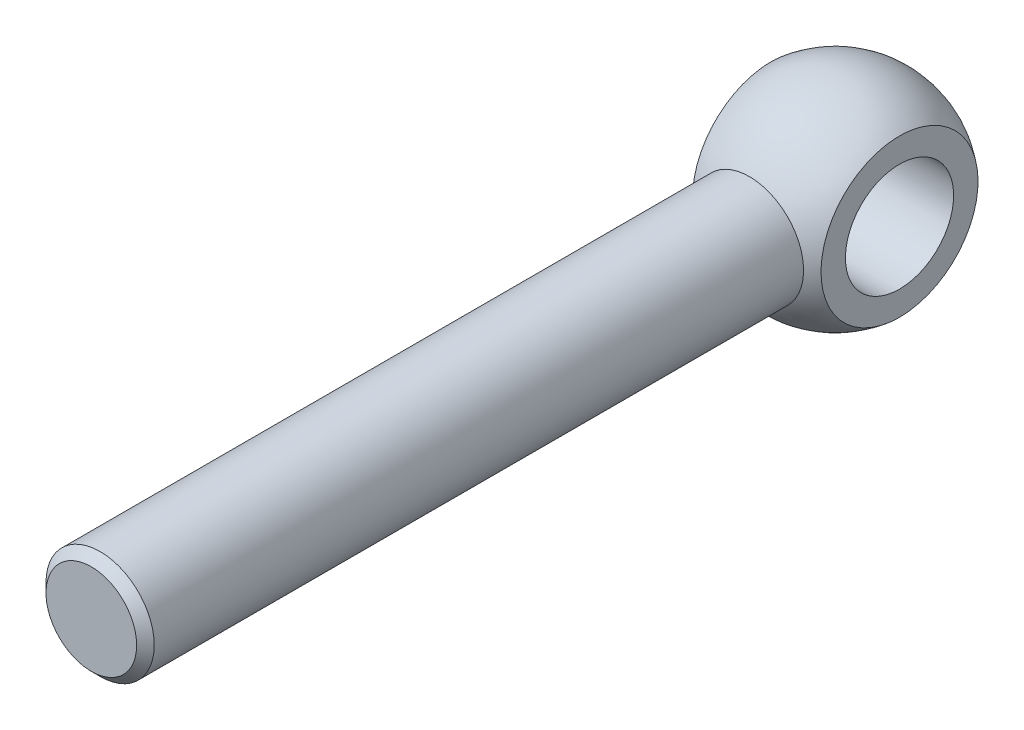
from build123d import *

# Parameters (mm, degrees)
ENL_V_MAT_EXTRU_1_DEPTH      = 13.990381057
ENL_V_MAT_EXTRU_1_DEPTH_BACK = 13.990381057
ESQUISSE2_W                  = 4.929621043
ESQUISSE2_H                  = 15.734662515
ESQUISSE2_W_2                = 6.563274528
ESQUISSE3_R                  = 4
BOSS_EXTRU_1_DEPTH           = 55
CHANFREIN1_SIZE              = 0.65
ESQUISSE4_R                  = 4
ENL_V_MAT_EXTRU_2_DEPTH      = 57.316072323


with BuildPart() as part:
    # Esquisse1 → R_volution1 (revolve)
    with BuildSketch(Plane.XY):
        with BuildLine():
            Line((0, 7.5), (0, -7.5))
            ThreePointArc((0, -7.5), (-7.5, 0), (0, 7.5))
        make_face()
    revolve(axis=Axis((0, 0, 0), (0, 1, 0)))

    # Esquisse2 → Enl_v. mat.-Extru.1 (cut, two sides: drawn at the far end of the back side and taken through both)
    with BuildSketch(Plane.XY.offset(-ENL_V_MAT_EXTRU_1_DEPTH_BACK)):
        with Locations((-7.214810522, -0.659193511)):
            Rectangle(ESQUISSE2_W, ESQUISSE2_H)
        with Locations((8.031637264, -0.659193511)):
            Rectangle(ESQUISSE2_W_2, ESQUISSE2_H)
    extrude(amount=ENL_V_MAT_EXTRU_1_DEPTH + ENL_V_MAT_EXTRU_1_DEPTH_BACK, mode=Mode.SUBTRACT)

    # Esquisse3 → Boss.-Extru.1 (add)
    with BuildSketch(Plane.XY):
        with Locations(Location((0, 0, 0), (0, 0, 180))):
            Circle(ESQUISSE3_R)
    extrude(amount=BOSS_EXTRU_1_DEPTH)

    # Chanfrein1
    chanfrein1_edges = [part.edges().sort_by_distance(p)[0] for p in [
        (4, 0, 55),
    ]]
    chamfer(chanfrein1_edges, length=CHANFREIN1_SIZE)

    # Esquisse4 → Enl_v. mat.-Extru.2 (cut, through all)
    with BuildSketch(Plane.ZY.offset(4.75)):
        with Locations(Location((0, 0, 0), (0, 0, 270))):
            Circle(ESQUISSE4_R)
    extrude(amount=-ENL_V_MAT_EXTRU_2_DEPTH, mode=Mode.SUBTRACT)


solid = part.part
